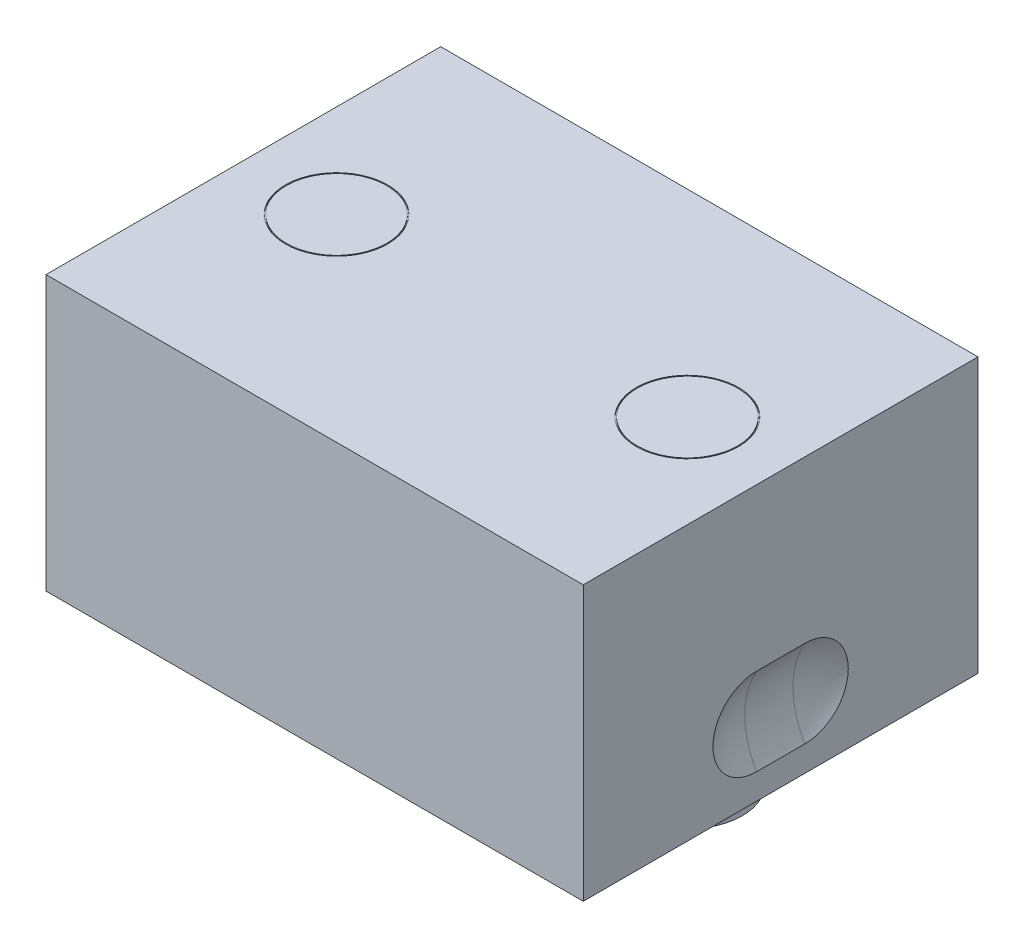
ISO-10303-21;
HEADER;
FILE_DESCRIPTION(('STEP AP214'),'2;1');
FILE_NAME('part.step','',(''),(''),'','','');
FILE_SCHEMA(('AUTOMOTIVE_DESIGN { 1 0 10303 214 1 1 1 1 }'));
ENDSEC;
DATA;
#1=APPLICATION_CONTEXT('core data for automotive mechanical design processes');
#2=APPLICATION_PROTOCOL_DEFINITION('international standard','automotive_design',2000,#1);
#3=PRODUCT_CONTEXT('',#1,'mechanical');
#4=PRODUCT('Part','Part','',(#3));
#5=PRODUCT_RELATED_PRODUCT_CATEGORY('part','',(#4));
#6=PRODUCT_DEFINITION_FORMATION('','',#4);
#7=PRODUCT_DEFINITION_CONTEXT('part definition',#1,'design');
#8=PRODUCT_DEFINITION('design','',#6,#7);
#9=PRODUCT_DEFINITION_SHAPE('','',#8);
#10=(LENGTH_UNIT() NAMED_UNIT(*) SI_UNIT(.MILLI.,.METRE.));
#11=(NAMED_UNIT(*) PLANE_ANGLE_UNIT() SI_UNIT($,.RADIAN.));
#12=(NAMED_UNIT(*) SI_UNIT($,.STERADIAN.) SOLID_ANGLE_UNIT());
#13=UNCERTAINTY_MEASURE_WITH_UNIT(LENGTH_MEASURE(1.E-05),#10,'distance_accuracy_value','');
#14=(GEOMETRIC_REPRESENTATION_CONTEXT(3) GLOBAL_UNCERTAINTY_ASSIGNED_CONTEXT((#13)) GLOBAL_UNIT_ASSIGNED_CONTEXT((#10,
#11,#12)) REPRESENTATION_CONTEXT('',''));
#15=CARTESIAN_POINT('',(0.,0.,0.));
#16=DIRECTION('',(0.,0.,1.));
#17=DIRECTION('',(1.,0.,0.));
#18=AXIS2_PLACEMENT_3D('',#15,#16,#17);
#19=CARTESIAN_POINT('',(-16.,72.,0.));
#20=DIRECTION('',(0.,1.,0.));
#21=DIRECTION('',(0.,0.,1.));
#22=AXIS2_PLACEMENT_3D('',#19,#20,#21);
#23=PLANE('',#22);
#24=CARTESIAN_POINT('',(-16.,72.,0.));
#25=DIRECTION('',(0.,-1.,0.));
#26=DIRECTION('',(0.,0.,-1.));
#27=AXIS2_PLACEMENT_3D('',#24,#25,#26);
#28=CIRCLE('',#27,4.57);
#29=CARTESIAN_POINT('',(-16.,72.,-4.57));
#30=VERTEX_POINT('',#29);
#31=EDGE_CURVE('E9',#30,#30,#28,.F.);
#32=ORIENTED_EDGE('',*,*,#31,.F.);
#33=EDGE_LOOP('',(#32));
#34=FACE_BOUND('',#33,.T.);
#35=ADVANCED_FACE('F14',(#34),#23,.F.);
#36=CARTESIAN_POINT('',(-16.,75.,0.));
#37=DIRECTION('',(0.,1.,0.));
#38=DIRECTION('',(0.,0.,1.));
#39=AXIS2_PLACEMENT_3D('',#36,#37,#38);
#40=PLANE('',#39);
#41=CARTESIAN_POINT('',(16.,75.,0.));
#42=DIRECTION('',(0.,1.,0.));
#43=DIRECTION('',(0.,0.,1.));
#44=AXIS2_PLACEMENT_3D('',#41,#42,#43);
#45=CIRCLE('',#44,4.67);
#46=CARTESIAN_POINT('',(16.,75.,4.67));
#47=VERTEX_POINT('',#46);
#48=EDGE_CURVE('E576',#47,#47,#45,.T.);
#49=ORIENTED_EDGE('',*,*,#48,.F.);
#50=EDGE_LOOP('',(#49));
#51=FACE_BOUND('',#50,.T.);
#52=CARTESIAN_POINT('',(-16.,75.,0.));
#53=DIRECTION('',(0.,1.,0.));
#54=DIRECTION('',(0.,0.,1.));
#55=AXIS2_PLACEMENT_3D('',#52,#53,#54);
#56=CIRCLE('',#55,4.67);
#57=CARTESIAN_POINT('',(-16.,75.,4.67));
#58=VERTEX_POINT('',#57);
#59=EDGE_CURVE('E590',#58,#58,#56,.T.);
#60=ORIENTED_EDGE('',*,*,#59,.F.);
#61=EDGE_LOOP('',(#60));
#62=FACE_BOUND('',#61,.T.);
#63=DIRECTION('',(1.,0.,0.));
#64=VECTOR('',#63,1.);
#65=CARTESIAN_POINT('',(0.,75.,-18.));
#66=LINE('',#65,#64);
#67=CARTESIAN_POINT('',(24.5,75.,-18.));
#68=VERTEX_POINT('',#67);
#69=CARTESIAN_POINT('',(-24.5,75.,-18.));
#70=VERTEX_POINT('',#69);
#71=EDGE_CURVE('E208',#68,#70,#66,.F.);
#72=ORIENTED_EDGE('',*,*,#71,.T.);
#73=DIRECTION('',(0.,0.,1.));
#74=VECTOR('',#73,1.);
#75=CARTESIAN_POINT('',(-24.5,75.,0.));
#76=LINE('',#75,#74);
#77=CARTESIAN_POINT('',(-24.5,75.,18.));
#78=VERTEX_POINT('',#77);
#79=EDGE_CURVE('E205',#70,#78,#76,.T.);
#80=ORIENTED_EDGE('',*,*,#79,.T.);
#81=DIRECTION('',(1.,0.,0.));
#82=VECTOR('',#81,1.);
#83=CARTESIAN_POINT('',(0.,75.,18.));
#84=LINE('',#83,#82);
#85=CARTESIAN_POINT('',(24.5,75.,18.));
#86=VERTEX_POINT('',#85);
#87=EDGE_CURVE('E244',#78,#86,#84,.T.);
#88=ORIENTED_EDGE('',*,*,#87,.T.);
#89=DIRECTION('',(0.,0.,1.));
#90=VECTOR('',#89,1.);
#91=CARTESIAN_POINT('',(24.5,75.,0.));
#92=LINE('',#91,#90);
#93=EDGE_CURVE('E247',#86,#68,#92,.F.);
#94=ORIENTED_EDGE('',*,*,#93,.T.);
#95=EDGE_LOOP('',(#72,#80,#88,#94));
#96=FACE_BOUND('',#95,.T.);
#97=ADVANCED_FACE('F186',(#51,#62,#96),#40,.T.);
#98=CARTESIAN_POINT('',(16.,72.,0.));
#99=DIRECTION('',(0.,1.,0.));
#100=DIRECTION('',(0.,0.,1.));
#101=AXIS2_PLACEMENT_3D('',#98,#99,#100);
#102=PLANE('',#101);
#103=CARTESIAN_POINT('',(16.,72.,0.));
#104=DIRECTION('',(0.,-1.,0.));
#105=DIRECTION('',(0.,0.,-1.));
#106=AXIS2_PLACEMENT_3D('',#103,#104,#105);
#107=CIRCLE('',#106,4.57);
#108=CARTESIAN_POINT('',(16.,72.,-4.57));
#109=VERTEX_POINT('',#108);
#110=EDGE_CURVE('E23',#109,#109,#107,.F.);
#111=ORIENTED_EDGE('',*,*,#110,.F.);
#112=EDGE_LOOP('',(#111));
#113=FACE_BOUND('',#112,.T.);
#114=ADVANCED_FACE('F133',(#113),#102,.F.);
#115=CARTESIAN_POINT('',(16.,62.5,0.));
#116=DIRECTION('',(0.,-1.,0.));
#117=DIRECTION('',(0.,0.,-1.));
#118=AXIS2_PLACEMENT_3D('',#115,#116,#117);
#119=CYLINDRICAL_SURFACE('',#118,4.57);
#120=CARTESIAN_POINT('',(16.,53.,0.));
#121=DIRECTION('',(0.,-1.,0.));
#122=DIRECTION('',(0.,0.,-1.));
#123=AXIS2_PLACEMENT_3D('',#120,#121,#122);
#124=CIRCLE('',#123,4.57);
#125=CARTESIAN_POINT('',(16.,53.,-4.57));
#126=VERTEX_POINT('',#125);
#127=EDGE_CURVE('E217',#126,#126,#124,.F.);
#128=ORIENTED_EDGE('',*,*,#127,.F.);
#129=EDGE_LOOP('',(#128));
#130=FACE_BOUND('',#129,.T.);
#131=ORIENTED_EDGE('',*,*,#110,.T.);
#132=EDGE_LOOP('',(#131));
#133=FACE_BOUND('',#132,.T.);
#134=ADVANCED_FACE('F185',(#130,#133),#119,.F.);
#135=CARTESIAN_POINT('',(19.785,53.,0.));
#136=DIRECTION('',(0.,-1.,0.));
#137=DIRECTION('',(0.,0.,-1.));
#138=AXIS2_PLACEMENT_3D('',#135,#136,#137);
#139=PLANE('',#138);
#140=ORIENTED_EDGE('',*,*,#127,.T.);
#141=EDGE_LOOP('',(#140));
#142=FACE_BOUND('',#141,.T.);
#143=CARTESIAN_POINT('',(16.,52.9999999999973,0.));
#144=DIRECTION('',(0.,1.,0.));
#145=DIRECTION('',(0.,0.,1.));
#146=AXIS2_PLACEMENT_3D('',#143,#144,#145);
#147=CIRCLE('',#146,3.00000000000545);
#148=CARTESIAN_POINT('',(16.,52.9999999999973,3.00000000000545));
#149=VERTEX_POINT('',#148);
#150=EDGE_CURVE('E228',#149,#149,#147,.T.);
#151=ORIENTED_EDGE('',*,*,#150,.F.);
#152=EDGE_LOOP('',(#151));
#153=FACE_BOUND('',#152,.T.);
#154=ADVANCED_FACE('F193',(#142,#153),#139,.F.);
#155=CARTESIAN_POINT('',(16.,52.9999999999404,0.));
#156=DIRECTION('',(0.,1.,0.));
#157=DIRECTION('',(0.,0.,1.));
#158=AXIS2_PLACEMENT_3D('',#155,#156,#157);
#159=CONICAL_SURFACE('',#158,2.99999999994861,0.785398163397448);
#160=CARTESIAN_POINT('',(16.,52.6,0.));
#161=DIRECTION('',(0.,-1.,0.));
#162=DIRECTION('',(0.,0.,-1.));
#163=AXIS2_PLACEMENT_3D('',#160,#161,#162);
#164=CIRCLE('',#163,2.6);
#165=CARTESIAN_POINT('',(16.,52.6,-2.6));
#166=VERTEX_POINT('',#165);
#167=EDGE_CURVE('E233',#166,#166,#164,.T.);
#168=ORIENTED_EDGE('',*,*,#167,.T.);
#169=EDGE_LOOP('',(#168));
#170=FACE_BOUND('',#169,.T.);
#171=ORIENTED_EDGE('',*,*,#150,.T.);
#172=EDGE_LOOP('',(#171));
#173=FACE_BOUND('',#172,.T.);
#174=ADVANCED_FACE('F316',(#170,#173),#159,.F.);
#175=CARTESIAN_POINT('',(16.,49.3,0.));
#176=DIRECTION('',(0.,-1.,0.));
#177=DIRECTION('',(0.,0.,-1.));
#178=AXIS2_PLACEMENT_3D('',#175,#176,#177);
#179=CYLINDRICAL_SURFACE('',#178,2.6);
#180=CARTESIAN_POINT('',(16.,46.,0.));
#181=DIRECTION('',(0.,-1.,0.));
#182=DIRECTION('',(0.,0.,-1.));
#183=AXIS2_PLACEMENT_3D('',#180,#181,#182);
#184=CIRCLE('',#183,2.6);
#185=CARTESIAN_POINT('',(16.,46.,-2.6));
#186=VERTEX_POINT('',#185);
#187=EDGE_CURVE('E223',#186,#186,#184,.F.);
#188=ORIENTED_EDGE('',*,*,#187,.F.);
#189=EDGE_LOOP('',(#188));
#190=FACE_BOUND('',#189,.T.);
#191=ORIENTED_EDGE('',*,*,#167,.F.);
#192=EDGE_LOOP('',(#191));
#193=FACE_BOUND('',#192,.T.);
#194=ADVANCED_FACE('F317',(#190,#193),#179,.F.);
#195=CARTESIAN_POINT('',(18.5,46.,0.));
#196=DIRECTION('',(0.,-1.,0.));
#197=DIRECTION('',(0.,0.,-1.));
#198=AXIS2_PLACEMENT_3D('',#195,#196,#197);
#199=PLANE('',#198);
#200=CARTESIAN_POINT('',(16.,46.,0.));
#201=DIRECTION('',(0.,-1.,0.));
#202=DIRECTION('',(0.,0.,-1.));
#203=AXIS2_PLACEMENT_3D('',#200,#201,#202);
#204=CIRCLE('',#203,5.);
#205=CARTESIAN_POINT('',(16.,46.,-5.));
#206=VERTEX_POINT('',#205);
#207=EDGE_CURVE('E79',#206,#206,#204,.F.);
#208=ORIENTED_EDGE('',*,*,#207,.F.);
#209=EDGE_LOOP('',(#208));
#210=FACE_BOUND('',#209,.T.);
#211=ORIENTED_EDGE('',*,*,#187,.T.);
#212=EDGE_LOOP('',(#211));
#213=FACE_BOUND('',#212,.T.);
#214=ADVANCED_FACE('F302',(#210,#213),#199,.T.);
#215=CARTESIAN_POINT('',(-16.,48.5,0.));
#216=DIRECTION('',(0.,-1.,0.));
#217=DIRECTION('',(0.,0.,-1.));
#218=AXIS2_PLACEMENT_3D('',#215,#216,#217);
#219=CYLINDRICAL_SURFACE('',#218,5.);
#220=CARTESIAN_POINT('',(-16.,50.,0.));
#221=DIRECTION('',(0.,-1.,0.));
#222=DIRECTION('',(0.,0.,-1.));
#223=AXIS2_PLACEMENT_3D('',#220,#221,#222);
#224=CIRCLE('',#223,5.);
#225=CARTESIAN_POINT('',(-16.,50.,-5.));
#226=VERTEX_POINT('',#225);
#227=EDGE_CURVE('E283',#226,#226,#224,.T.);
#228=ORIENTED_EDGE('',*,*,#227,.T.);
#229=EDGE_LOOP('',(#228));
#230=FACE_BOUND('',#229,.T.);
#231=CARTESIAN_POINT('',(-16.,46.,0.));
#232=DIRECTION('',(0.,-1.,0.));
#233=DIRECTION('',(0.,0.,-1.));
#234=AXIS2_PLACEMENT_3D('',#231,#232,#233);
#235=CIRCLE('',#234,5.);
#236=CARTESIAN_POINT('',(-16.,46.,-5.));
#237=VERTEX_POINT('',#236);
#238=EDGE_CURVE('E214',#237,#237,#235,.F.);
#239=ORIENTED_EDGE('',*,*,#238,.T.);
#240=EDGE_LOOP('',(#239));
#241=FACE_BOUND('',#240,.T.);
#242=ADVANCED_FACE('F197',(#230,#241),#219,.T.);
#243=CARTESIAN_POINT('',(16.,48.5,0.));
#244=DIRECTION('',(0.,-1.,0.));
#245=DIRECTION('',(0.,0.,-1.));
#246=AXIS2_PLACEMENT_3D('',#243,#244,#245);
#247=CYLINDRICAL_SURFACE('',#246,5.);
#248=CARTESIAN_POINT('',(16.,50.,0.));
#249=DIRECTION('',(0.,-1.,0.));
#250=DIRECTION('',(0.,0.,-1.));
#251=AXIS2_PLACEMENT_3D('',#248,#249,#250);
#252=CIRCLE('',#251,5.);
#253=CARTESIAN_POINT('',(16.,50.,-5.));
#254=VERTEX_POINT('',#253);
#255=EDGE_CURVE('E109',#254,#254,#252,.T.);
#256=ORIENTED_EDGE('',*,*,#255,.T.);
#257=EDGE_LOOP('',(#256));
#258=FACE_BOUND('',#257,.T.);
#259=ORIENTED_EDGE('',*,*,#207,.T.);
#260=EDGE_LOOP('',(#259));
#261=FACE_BOUND('',#260,.T.);
#262=ADVANCED_FACE('F301',(#258,#261),#247,.T.);
#263=CARTESIAN_POINT('',(31.3299999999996,56.3,2.20000000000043));
#264=DIRECTION('',(0.464793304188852,0.635942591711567,0.616071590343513));
#265=DIRECTION('',(0.885263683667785,-0.34681503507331,-0.309883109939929));
#266=AXIS2_PLACEMENT_3D('',#263,#264,#265);
#267=SPHERICAL_SURFACE('',#266,7.9);
#268=CARTESIAN_POINT('',(31.33,56.3,2.2));
#269=DIRECTION('',(0.,0.,-1.));
#270=DIRECTION('',(-1.,0.,0.));
#271=AXIS2_PLACEMENT_3D('',#268,#269,#270);
#272=CIRCLE('',#271,7.9);
#273=CARTESIAN_POINT('',(24.5,52.3299748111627,2.2));
#274=VERTEX_POINT('',#273);
#275=CARTESIAN_POINT('',(24.5,60.270025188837,2.2));
#276=VERTEX_POINT('',#275);
#277=EDGE_CURVE('E71',#274,#276,#272,.T.);
#278=ORIENTED_EDGE('',*,*,#277,.T.);
#279=CARTESIAN_POINT('',(24.5,52.3299748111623,2.2));
#280=CARTESIAN_POINT('',(24.5,52.3299641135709,2.31166044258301));
#281=CARTESIAN_POINT('',(24.5,52.3346855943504,2.42331581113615));
#282=CARTESIAN_POINT('',(24.5,52.3535101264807,2.64582772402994));
#283=CARTESIAN_POINT('',(24.5,52.3676127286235,2.75668430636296));
#284=CARTESIAN_POINT('',(24.5,52.4051035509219,2.97674344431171));
#285=CARTESIAN_POINT('',(24.5,52.4284852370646,3.08594710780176));
#286=CARTESIAN_POINT('',(24.5,52.4843445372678,3.30196987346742));
#287=CARTESIAN_POINT('',(24.5,52.516822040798,3.4087890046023));
#288=CARTESIAN_POINT('',(24.5,52.627634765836,3.72463545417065));
#289=CARTESIAN_POINT('',(24.5,52.7193661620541,3.92914501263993));
#290=CARTESIAN_POINT('',(24.5,52.9357981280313,4.31970636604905));
#291=CARTESIAN_POINT('',(24.5,53.0604922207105,4.50576177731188));
#292=CARTESIAN_POINT('',(24.5,53.339358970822,4.85433446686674));
#293=CARTESIAN_POINT('',(24.5,53.4935322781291,5.01685122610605));
#294=CARTESIAN_POINT('',(24.5,53.8269954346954,5.31371134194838));
#295=CARTESIAN_POINT('',(24.5,54.0062891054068,5.44805040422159));
#296=CARTESIAN_POINT('',(24.5,54.3848790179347,5.68471531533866));
#297=CARTESIAN_POINT('',(24.5,54.5841743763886,5.78704257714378));
#298=CARTESIAN_POINT('',(24.5,54.9971025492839,5.95677870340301));
#299=CARTESIAN_POINT('',(24.5,55.2107344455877,6.02418980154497));
#300=CARTESIAN_POINT('',(24.5,55.6462877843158,6.12219183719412));
#301=CARTESIAN_POINT('',(24.5,55.8682093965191,6.15278202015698));
#302=CARTESIAN_POINT('',(24.5,56.3140435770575,6.17627135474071));
#303=CARTESIAN_POINT('',(24.5,56.5379561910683,6.16916963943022));
#304=CARTESIAN_POINT('',(24.5,56.9814086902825,6.11747528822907));
#305=CARTESIAN_POINT('',(24.5,57.2009486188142,6.07288302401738));
#306=CARTESIAN_POINT('',(24.5,57.6294255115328,5.9474733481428));
#307=CARTESIAN_POINT('',(24.5,57.8383625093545,5.86665605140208));
#308=CARTESIAN_POINT('',(24.5,58.23970747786,5.67109073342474));
#309=CARTESIAN_POINT('',(24.4999999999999,58.432115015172,5.55634182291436));
#310=CARTESIAN_POINT('',(24.5000000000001,58.7949275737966,5.29616752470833));
#311=CARTESIAN_POINT('',(24.5000000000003,58.9653336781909,5.15074364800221));
#312=CARTESIAN_POINT('',(24.5000000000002,59.2792822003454,4.83340459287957));
#313=CARTESIAN_POINT('',(24.5,59.4228282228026,4.66149297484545));
#314=CARTESIAN_POINT('',(24.5,59.6791046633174,4.29583833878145));
#315=CARTESIAN_POINT('',(24.5000000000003,59.791825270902,4.10208839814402));
#316=CARTESIAN_POINT('',(24.5000000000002,59.93528242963,3.79948806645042));
#317=CARTESIAN_POINT('',(24.5,59.9788567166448,3.69653366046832));
#318=CARTESIAN_POINT('',(24.5,60.0571708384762,3.48732952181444));
#319=CARTESIAN_POINT('',(24.5,60.0919139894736,3.38108104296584));
#320=CARTESIAN_POINT('',(24.5,60.1522829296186,3.16616218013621));
#321=CARTESIAN_POINT('',(24.4999999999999,60.1779187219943,3.05749459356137));
#322=CARTESIAN_POINT('',(24.5000000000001,60.2199409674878,2.83842795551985));
#323=CARTESIAN_POINT('',(24.5000000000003,60.2363319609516,2.72802978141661));
#324=CARTESIAN_POINT('',(24.5000000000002,60.2553736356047,2.54782627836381));
#325=CARTESIAN_POINT('',(24.5000000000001,60.2608714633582,2.4783092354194));
#326=CARTESIAN_POINT('',(24.4999999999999,60.2681945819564,2.33919724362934));
#327=CARTESIAN_POINT('',(24.4999999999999,60.2700259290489,2.26960261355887));
#328=CARTESIAN_POINT('',(24.5,60.2700251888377,2.2));
#329=B_SPLINE_CURVE_WITH_KNOTS('',3,(#279,#280,#281,#282,#283,#284,#285,#286,#287,#288,#289,
#290,#291,#292,#293,#294,#295,#296,#297,#298,#299,#300,#301,#302,#303,#304,#305,#306,#307,#308,
#309,#310,#311,#312,#313,#314,#315,#316,#317,#318,#319,#320,#321,#322,#323,#324,#325,#326,#327,
#328),.UNSPECIFIED.,.F.,.F.,(4,2,2,2,2,2,2,2,2,2,2,2,2,2,2,2,2,2,2,2,2,2,2,2,4),(0.,
0.334872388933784,0.669728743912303,1.00434972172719,1.33896663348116,2.00792040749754,
2.67674283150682,3.34558000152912,4.01451902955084,4.68342852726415,5.35229522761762,
6.02117563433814,6.69007142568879,7.35896058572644,8.02784762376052,8.69675219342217,
9.36562382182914,10.0344056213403,10.7034000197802,11.0384618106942,11.3733975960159,
11.7079643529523,12.0423666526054,12.2514802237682,12.4602480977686),.UNSPECIFIED.);
#330=EDGE_CURVE('E76',#274,#276,#329,.T.);
#331=ORIENTED_EDGE('',*,*,#330,.F.);
#332=EDGE_LOOP('',(#278,#331));
#333=FACE_BOUND('',#332,.T.);
#334=ADVANCED_FACE('F74',(#333),#267,.F.);
#335=CARTESIAN_POINT('',(31.3299999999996,56.3,-2.20000000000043));
#336=DIRECTION('',(0.464793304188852,0.635942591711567,0.616071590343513));
#337=DIRECTION('',(0.885263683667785,-0.34681503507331,-0.309883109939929));
#338=AXIS2_PLACEMENT_3D('',#335,#336,#337);
#339=SPHERICAL_SURFACE('',#338,7.9);
#340=CARTESIAN_POINT('',(31.33,56.3,-2.2));
#341=DIRECTION('',(0.,0.,-1.));
#342=DIRECTION('',(-1.,0.,0.));
#343=AXIS2_PLACEMENT_3D('',#340,#341,#342);
#344=CIRCLE('',#343,7.9);
#345=CARTESIAN_POINT('',(24.5,52.329974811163,-2.2));
#346=VERTEX_POINT('',#345);
#347=CARTESIAN_POINT('',(24.5,60.2700251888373,-2.2));
#348=VERTEX_POINT('',#347);
#349=EDGE_CURVE('E78',#346,#348,#344,.T.);
#350=ORIENTED_EDGE('',*,*,#349,.F.);
#351=CARTESIAN_POINT('',(24.5,60.2700251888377,-2.2));
#352=CARTESIAN_POINT('',(24.5,60.2700358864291,-2.31166044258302));
#353=CARTESIAN_POINT('',(24.5,60.2653144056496,-2.42331581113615));
#354=CARTESIAN_POINT('',(24.5,60.2464898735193,-2.64582772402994));
#355=CARTESIAN_POINT('',(24.5,60.2323872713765,-2.75668430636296));
#356=CARTESIAN_POINT('',(24.5,60.1948964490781,-2.97674344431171));
#357=CARTESIAN_POINT('',(24.5,60.1715147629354,-3.08594710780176));
#358=CARTESIAN_POINT('',(24.5,60.1156554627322,-3.30196987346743));
#359=CARTESIAN_POINT('',(24.5,60.0831779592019,-3.4087890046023));
#360=CARTESIAN_POINT('',(24.5,59.972365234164,-3.72463545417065));
#361=CARTESIAN_POINT('',(24.5,59.8806338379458,-3.92914501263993));
#362=CARTESIAN_POINT('',(24.5,59.6642018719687,-4.31970636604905));
#363=CARTESIAN_POINT('',(24.5,59.5395077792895,-4.50576177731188));
#364=CARTESIAN_POINT('',(24.5,59.260641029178,-4.85433446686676));
#365=CARTESIAN_POINT('',(24.5,59.1064677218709,-5.01685122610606));
#366=CARTESIAN_POINT('',(24.5,58.7730045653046,-5.3137113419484));
#367=CARTESIAN_POINT('',(24.5,58.5937108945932,-5.4480504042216));
#368=CARTESIAN_POINT('',(24.5,58.2151209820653,-5.68471531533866));
#369=CARTESIAN_POINT('',(24.5,58.0158256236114,-5.78704257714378));
#370=CARTESIAN_POINT('',(24.5,57.6028974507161,-5.956778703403));
#371=CARTESIAN_POINT('',(24.5,57.3892655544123,-6.02418980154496));
#372=CARTESIAN_POINT('',(24.5,56.9537122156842,-6.12219183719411));
#373=CARTESIAN_POINT('',(24.5,56.7317906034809,-6.15278202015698));
#374=CARTESIAN_POINT('',(24.5,56.2859564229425,-6.17627135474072));
#375=CARTESIAN_POINT('',(24.5,56.0620438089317,-6.16916963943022));
#376=CARTESIAN_POINT('',(24.5,55.6185913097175,-6.11747528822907));
#377=CARTESIAN_POINT('',(24.5,55.3990513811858,-6.07288302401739));
#378=CARTESIAN_POINT('',(24.5,54.9705744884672,-5.94747334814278));
#379=CARTESIAN_POINT('',(24.5,54.7616374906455,-5.86665605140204));
#380=CARTESIAN_POINT('',(24.5,54.3602925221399,-5.67109073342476));
#381=CARTESIAN_POINT('',(24.5,54.1678849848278,-5.55634182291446));
#382=CARTESIAN_POINT('',(24.5,53.8050724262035,-5.2961675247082));
#383=CARTESIAN_POINT('',(24.5,53.6346663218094,-5.15074364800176));
#384=CARTESIAN_POINT('',(24.5,53.3207177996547,-4.83340459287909));
#385=CARTESIAN_POINT('',(24.5,53.1771717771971,-4.66149297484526));
#386=CARTESIAN_POINT('',(24.5,52.9208953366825,-4.29583833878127));
#387=CARTESIAN_POINT('',(24.5,52.8081747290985,-4.10208839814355));
#388=CARTESIAN_POINT('',(24.5,52.6647175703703,-3.79948806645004));
#389=CARTESIAN_POINT('',(24.5,52.6211432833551,-3.69653366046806));
#390=CARTESIAN_POINT('',(24.5,52.5428291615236,-3.48732952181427));
#391=CARTESIAN_POINT('',(24.5,52.5080860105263,-3.38108104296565));
#392=CARTESIAN_POINT('',(24.5,52.4477170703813,-3.16616218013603));
#393=CARTESIAN_POINT('',(24.5,52.4220812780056,-3.05749459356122));
#394=CARTESIAN_POINT('',(24.5,52.3800590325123,-2.83842795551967));
#395=CARTESIAN_POINT('',(24.5,52.3636680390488,-2.72802978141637));
#396=CARTESIAN_POINT('',(24.5,52.3446263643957,-2.54782627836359));
#397=CARTESIAN_POINT('',(24.5,52.3391285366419,-2.47830923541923));
#398=CARTESIAN_POINT('',(24.5,52.3318054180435,-2.33919724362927));
#399=CARTESIAN_POINT('',(24.5,52.3299740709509,-2.26960261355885));
#400=CARTESIAN_POINT('',(24.5,52.3299748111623,-2.2));
#401=B_SPLINE_CURVE_WITH_KNOTS('',3,(#351,#352,#353,#354,#355,#356,#357,#358,#359,#360,#361,
#362,#363,#364,#365,#366,#367,#368,#369,#370,#371,#372,#373,#374,#375,#376,#377,#378,#379,#380,
#381,#382,#383,#384,#385,#386,#387,#388,#389,#390,#391,#392,#393,#394,#395,#396,#397,#398,#399,
#400),.UNSPECIFIED.,.F.,.F.,(4,2,2,2,2,2,2,2,2,2,2,2,2,2,2,2,2,2,2,2,2,2,2,2,4),(0.,
0.334872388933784,0.669728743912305,1.00434972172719,1.33896663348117,2.00792040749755,
2.67674283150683,3.34558000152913,4.01451902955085,4.68342852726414,5.35229522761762,
6.02117563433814,6.69007142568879,7.35896058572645,8.02784762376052,8.69675219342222,
9.3656238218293,10.0344056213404,10.7034000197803,11.0384618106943,11.373397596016,
11.7079643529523,12.0423666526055,12.2514802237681,12.4602480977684),.UNSPECIFIED.);
#402=EDGE_CURVE('E88',#348,#346,#401,.T.);
#403=ORIENTED_EDGE('',*,*,#402,.F.);
#404=EDGE_LOOP('',(#350,#403));
#405=FACE_BOUND('',#404,.T.);
#406=ADVANCED_FACE('F159',(#405),#339,.F.);
#407=CARTESIAN_POINT('',(31.33,56.3,0.));
#408=DIRECTION('',(0.,0.,-1.));
#409=DIRECTION('',(-1.,0.,0.));
#410=AXIS2_PLACEMENT_3D('',#407,#408,#409);
#411=CYLINDRICAL_SURFACE('',#410,7.9);
#412=ORIENTED_EDGE('',*,*,#277,.F.);
#413=DIRECTION('',(0.,0.,-1.));
#414=VECTOR('',#413,1.);
#415=CARTESIAN_POINT('',(24.5,52.329974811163,-18.));
#416=LINE('',#415,#414);
#417=EDGE_CURVE('E91',#346,#274,#416,.F.);
#418=ORIENTED_EDGE('',*,*,#417,.F.);
#419=ORIENTED_EDGE('',*,*,#349,.T.);
#420=DIRECTION('',(0.,0.,-1.));
#421=VECTOR('',#420,1.);
#422=CARTESIAN_POINT('',(24.5,60.270025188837,-18.));
#423=LINE('',#422,#421);
#424=EDGE_CURVE('E82',#276,#348,#423,.T.);
#425=ORIENTED_EDGE('',*,*,#424,.F.);
#426=EDGE_LOOP('',(#412,#418,#419,#425));
#427=FACE_BOUND('',#426,.T.);
#428=ADVANCED_FACE('F83',(#427),#411,.F.);
#429=CARTESIAN_POINT('',(-31.3299999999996,56.3,-2.20000000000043));
#430=DIRECTION('',(0.464793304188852,0.635942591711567,0.616071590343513));
#431=DIRECTION('',(0.885263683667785,-0.34681503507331,-0.309883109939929));
#432=AXIS2_PLACEMENT_3D('',#429,#430,#431);
#433=SPHERICAL_SURFACE('',#432,7.9);
#434=CARTESIAN_POINT('',(-31.33,56.3,-2.2));
#435=DIRECTION('',(0.,0.,1.));
#436=DIRECTION('',(1.,0.,0.));
#437=AXIS2_PLACEMENT_3D('',#434,#435,#436);
#438=CIRCLE('',#437,7.9);
#439=CARTESIAN_POINT('',(-24.5,52.3299748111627,-2.2));
#440=VERTEX_POINT('',#439);
#441=CARTESIAN_POINT('',(-24.5,60.270025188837,-2.2));
#442=VERTEX_POINT('',#441);
#443=EDGE_CURVE('E290',#440,#442,#438,.T.);
#444=ORIENTED_EDGE('',*,*,#443,.T.);
#445=CARTESIAN_POINT('',(-24.5,52.3299748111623,-2.2));
#446=CARTESIAN_POINT('',(-24.5,52.3299641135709,-2.311660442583));
#447=CARTESIAN_POINT('',(-24.5,52.3346855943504,-2.42331581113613));
#448=CARTESIAN_POINT('',(-24.5,52.3535101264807,-2.64582772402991));
#449=CARTESIAN_POINT('',(-24.5,52.3676127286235,-2.75668430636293));
#450=CARTESIAN_POINT('',(-24.5,52.4051035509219,-2.97674344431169));
#451=CARTESIAN_POINT('',(-24.5,52.4284852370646,-3.08594710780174));
#452=CARTESIAN_POINT('',(-24.5,52.4843445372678,-3.30196987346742));
#453=CARTESIAN_POINT('',(-24.5,52.516822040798,-3.40878900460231));
#454=CARTESIAN_POINT('',(-24.5,52.627634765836,-3.72463545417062));
#455=CARTESIAN_POINT('',(-24.4999999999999,52.7193661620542,-3.9291450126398));
#456=CARTESIAN_POINT('',(-24.5000000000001,52.9357981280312,-4.31970636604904));
#457=CARTESIAN_POINT('',(-24.5000000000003,53.06049222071,-4.50576177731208));
#458=CARTESIAN_POINT('',(-24.5000000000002,53.3393589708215,-4.85433446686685));
#459=CARTESIAN_POINT('',(-24.5,53.4935322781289,-5.01685122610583));
#460=CARTESIAN_POINT('',(-24.5,53.8269954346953,-5.31371134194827));
#461=CARTESIAN_POINT('',(-24.5000000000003,54.0062891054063,-5.44805040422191));
#462=CARTESIAN_POINT('',(-24.5000000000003,54.3848790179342,-5.68471531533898));
#463=CARTESIAN_POINT('',(-24.5,54.5841743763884,-5.78704257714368));
#464=CARTESIAN_POINT('',(-24.5,54.9971025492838,-5.95677870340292));
#465=CARTESIAN_POINT('',(-24.5000000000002,55.2107344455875,-6.02418980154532));
#466=CARTESIAN_POINT('',(-24.5000000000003,55.6462877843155,-6.12219183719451));
#467=CARTESIAN_POINT('',(-24.5000000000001,55.8682093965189,-6.15278202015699));
#468=CARTESIAN_POINT('',(-24.4999999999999,56.3140435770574,-6.17627135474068));
#469=CARTESIAN_POINT('',(-24.5,56.5379561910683,-6.16916963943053));
#470=CARTESIAN_POINT('',(-24.5,56.9814086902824,-6.11747528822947));
#471=CARTESIAN_POINT('',(-24.5,57.2009486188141,-6.07288302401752));
#472=CARTESIAN_POINT('',(-24.5,57.6294255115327,-5.94747334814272));
#473=CARTESIAN_POINT('',(-24.5,57.8383625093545,-5.86665605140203));
#474=CARTESIAN_POINT('',(-24.5,58.2397074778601,-5.67109073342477));
#475=CARTESIAN_POINT('',(-24.5,58.4321150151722,-5.55634182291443));
#476=CARTESIAN_POINT('',(-24.5,58.7949275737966,-5.29616752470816));
#477=CARTESIAN_POINT('',(-24.5,58.9653336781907,-5.15074364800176));
#478=CARTESIAN_POINT('',(-24.5,59.2792822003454,-4.83340459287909));
#479=CARTESIAN_POINT('',(-24.5,59.4228282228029,-4.66149297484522));
#480=CARTESIAN_POINT('',(-24.5,59.6791046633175,-4.29583833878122));
#481=CARTESIAN_POINT('',(-24.5,59.7918252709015,-4.10208839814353));
#482=CARTESIAN_POINT('',(-24.5,59.9352824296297,-3.79948806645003));
#483=CARTESIAN_POINT('',(-24.5,59.9788567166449,-3.69653366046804));
#484=CARTESIAN_POINT('',(-24.5,60.0571708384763,-3.48732952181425));
#485=CARTESIAN_POINT('',(-24.5,60.0919139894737,-3.38108104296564));
#486=CARTESIAN_POINT('',(-24.5,60.1522829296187,-3.16616218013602));
#487=CARTESIAN_POINT('',(-24.5,60.1779187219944,-3.05749459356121));
#488=CARTESIAN_POINT('',(-24.5,60.2199409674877,-2.83842795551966));
#489=CARTESIAN_POINT('',(-24.5,60.2363319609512,-2.72802978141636));
#490=CARTESIAN_POINT('',(-24.5,60.2553736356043,-2.54782627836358));
#491=CARTESIAN_POINT('',(-24.5,60.2608714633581,-2.47830923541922));
#492=CARTESIAN_POINT('',(-24.5,60.2681945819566,-2.33919724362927));
#493=CARTESIAN_POINT('',(-24.5,60.2700259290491,-2.26960261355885));
#494=CARTESIAN_POINT('',(-24.5,60.2700251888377,-2.2));
#495=B_SPLINE_CURVE_WITH_KNOTS('',3,(#445,#446,#447,#448,#449,#450,#451,#452,#453,#454,#455,
#456,#457,#458,#459,#460,#461,#462,#463,#464,#465,#466,#467,#468,#469,#470,#471,#472,#473,#474,
#475,#476,#477,#478,#479,#480,#481,#482,#483,#484,#485,#486,#487,#488,#489,#490,#491,#492,#493,
#494),.UNSPECIFIED.,.F.,.F.,(4,2,2,2,2,2,2,2,2,2,2,2,2,2,2,2,2,2,2,2,2,2,2,2,4),(0.,
0.334872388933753,0.669728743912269,1.00434972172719,1.33896663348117,2.00792040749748,
2.67674283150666,3.34558000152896,4.0145190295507,4.68342852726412,5.35229522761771,
6.02117563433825,6.69007142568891,7.35896058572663,8.02784762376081,8.69675219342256,
9.36562382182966,10.0344056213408,10.7034000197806,11.0384618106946,11.3733975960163,
11.7079643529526,12.0423666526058,12.2514802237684,12.4602480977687),.UNSPECIFIED.);
#496=EDGE_CURVE('E143',#440,#442,#495,.T.);
#497=ORIENTED_EDGE('',*,*,#496,.F.);
#498=EDGE_LOOP('',(#444,#497));
#499=FACE_BOUND('',#498,.T.);
#500=ADVANCED_FACE('F152',(#499),#433,.F.);
#501=CARTESIAN_POINT('',(-31.3299999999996,56.3,2.20000000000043));
#502=DIRECTION('',(0.464793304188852,0.635942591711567,0.616071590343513));
#503=DIRECTION('',(0.885263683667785,-0.34681503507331,-0.309883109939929));
#504=AXIS2_PLACEMENT_3D('',#501,#502,#503);
#505=SPHERICAL_SURFACE('',#504,7.9);
#506=CARTESIAN_POINT('',(-31.33,56.3,2.2));
#507=DIRECTION('',(0.,0.,1.));
#508=DIRECTION('',(1.,0.,0.));
#509=AXIS2_PLACEMENT_3D('',#506,#507,#508);
#510=CIRCLE('',#509,7.9);
#511=CARTESIAN_POINT('',(-24.5,52.329974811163,2.2));
#512=VERTEX_POINT('',#511);
#513=CARTESIAN_POINT('',(-24.5,60.2700251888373,2.2));
#514=VERTEX_POINT('',#513);
#515=EDGE_CURVE('E287',#512,#514,#510,.T.);
#516=ORIENTED_EDGE('',*,*,#515,.F.);
#517=CARTESIAN_POINT('',(-24.5,60.2700251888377,2.2));
#518=CARTESIAN_POINT('',(-24.5,60.2700358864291,2.31166044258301));
#519=CARTESIAN_POINT('',(-24.5,60.2653144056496,2.42331581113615));
#520=CARTESIAN_POINT('',(-24.5,60.2464898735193,2.64582772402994));
#521=CARTESIAN_POINT('',(-24.5,60.2323872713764,2.75668430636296));
#522=CARTESIAN_POINT('',(-24.5,60.1948964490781,2.97674344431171));
#523=CARTESIAN_POINT('',(-24.5,60.1715147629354,3.08594710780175));
#524=CARTESIAN_POINT('',(-24.5,60.1156554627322,3.30196987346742));
#525=CARTESIAN_POINT('',(-24.5,60.0831779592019,3.4087890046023));
#526=CARTESIAN_POINT('',(-24.5,59.972365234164,3.72463545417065));
#527=CARTESIAN_POINT('',(-24.5,59.8806338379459,3.92914501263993));
#528=CARTESIAN_POINT('',(-24.5,59.6642018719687,4.31970636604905));
#529=CARTESIAN_POINT('',(-24.5,59.5395077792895,4.50576177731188));
#530=CARTESIAN_POINT('',(-24.5,59.260641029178,4.85433446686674));
#531=CARTESIAN_POINT('',(-24.5,59.1064677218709,5.01685122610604));
#532=CARTESIAN_POINT('',(-24.5,58.7730045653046,5.31371134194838));
#533=CARTESIAN_POINT('',(-24.5,58.5937108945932,5.44805040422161));
#534=CARTESIAN_POINT('',(-24.5,58.2151209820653,5.68471531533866));
#535=CARTESIAN_POINT('',(-24.5,58.0158256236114,5.78704257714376));
#536=CARTESIAN_POINT('',(-24.5,57.6028974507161,5.95677870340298));
#537=CARTESIAN_POINT('',(-24.5,57.3892655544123,6.02418980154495));
#538=CARTESIAN_POINT('',(-24.5,56.9537122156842,6.1221918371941));
#539=CARTESIAN_POINT('',(-24.5,56.7317906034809,6.15278202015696));
#540=CARTESIAN_POINT('',(-24.5,56.2859564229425,6.1762713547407));
#541=CARTESIAN_POINT('',(-24.5,56.0620438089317,6.16916963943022));
#542=CARTESIAN_POINT('',(-24.5,55.6185913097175,6.11747528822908));
#543=CARTESIAN_POINT('',(-24.5,55.3990513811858,6.07288302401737));
#544=CARTESIAN_POINT('',(-24.5,54.9705744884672,5.94747334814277));
#545=CARTESIAN_POINT('',(-24.5,54.7616374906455,5.86665605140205));
#546=CARTESIAN_POINT('',(-24.5,54.3602925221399,5.67109073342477));
#547=CARTESIAN_POINT('',(-24.5,54.1678849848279,5.55634182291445));
#548=CARTESIAN_POINT('',(-24.5,53.8050724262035,5.29616752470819));
#549=CARTESIAN_POINT('',(-24.5,53.6346663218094,5.15074364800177));
#550=CARTESIAN_POINT('',(-24.5,53.3207177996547,4.83340459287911));
#551=CARTESIAN_POINT('',(-24.5,53.1771717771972,4.66149297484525));
#552=CARTESIAN_POINT('',(-24.5,52.9208953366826,4.29583833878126));
#553=CARTESIAN_POINT('',(-24.5,52.8081747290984,4.10208839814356));
#554=CARTESIAN_POINT('',(-24.5,52.6647175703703,3.79948806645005));
#555=CARTESIAN_POINT('',(-24.5,52.6211432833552,3.69653366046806));
#556=CARTESIAN_POINT('',(-24.5,52.5428291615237,3.48732952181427));
#557=CARTESIAN_POINT('',(-24.5,52.5080860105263,3.38108104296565));
#558=CARTESIAN_POINT('',(-24.5,52.4477170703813,3.16616218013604));
#559=CARTESIAN_POINT('',(-24.5,52.4220812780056,3.05749459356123));
#560=CARTESIAN_POINT('',(-24.5,52.3800590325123,2.83842795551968));
#561=CARTESIAN_POINT('',(-24.5,52.3636680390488,2.72802978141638));
#562=CARTESIAN_POINT('',(-24.5,52.3446263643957,2.54782627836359));
#563=CARTESIAN_POINT('',(-24.5,52.3391285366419,2.47830923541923));
#564=CARTESIAN_POINT('',(-24.5,52.3318054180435,2.33919724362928));
#565=CARTESIAN_POINT('',(-24.5,52.3299740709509,2.26960261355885));
#566=CARTESIAN_POINT('',(-24.5,52.3299748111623,2.2));
#567=B_SPLINE_CURVE_WITH_KNOTS('',3,(#517,#518,#519,#520,#521,#522,#523,#524,#525,#526,#527,
#528,#529,#530,#531,#532,#533,#534,#535,#536,#537,#538,#539,#540,#541,#542,#543,#544,#545,#546,
#547,#548,#549,#550,#551,#552,#553,#554,#555,#556,#557,#558,#559,#560,#561,#562,#563,#564,#565,
#566),.UNSPECIFIED.,.F.,.F.,(4,2,2,2,2,2,2,2,2,2,2,2,2,2,2,2,2,2,2,2,2,2,2,2,4),(0.,
0.334872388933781,0.669728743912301,1.00434972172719,1.33896663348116,2.00792040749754,
2.67674283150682,3.34558000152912,4.01451902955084,4.68342852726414,5.35229522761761,
6.02117563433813,6.69007142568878,7.35896058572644,8.0278476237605,8.6967521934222,
9.36562382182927,10.0344056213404,10.7034000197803,11.0384618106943,11.373397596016,
11.7079643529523,12.0423666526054,12.2514802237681,12.4602480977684),.UNSPECIFIED.);
#568=EDGE_CURVE('E136',#514,#512,#567,.T.);
#569=ORIENTED_EDGE('',*,*,#568,.F.);
#570=EDGE_LOOP('',(#516,#569));
#571=FACE_BOUND('',#570,.T.);
#572=ADVANCED_FACE('F157',(#571),#505,.F.);
#573=CARTESIAN_POINT('',(-31.33,56.3,0.));
#574=DIRECTION('',(0.,0.,1.));
#575=DIRECTION('',(1.,0.,0.));
#576=AXIS2_PLACEMENT_3D('',#573,#574,#575);
#577=CYLINDRICAL_SURFACE('',#576,7.9);
#578=ORIENTED_EDGE('',*,*,#443,.F.);
#579=DIRECTION('',(0.,0.,1.));
#580=VECTOR('',#579,1.);
#581=CARTESIAN_POINT('',(-24.5,52.329974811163,18.));
#582=LINE('',#581,#580);
#583=EDGE_CURVE('E151',#512,#440,#582,.F.);
#584=ORIENTED_EDGE('',*,*,#583,.F.);
#585=ORIENTED_EDGE('',*,*,#515,.T.);
#586=DIRECTION('',(0.,0.,1.));
#587=VECTOR('',#586,1.);
#588=CARTESIAN_POINT('',(-24.5,60.270025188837,18.));
#589=LINE('',#588,#587);
#590=EDGE_CURVE('E150',#442,#514,#589,.T.);
#591=ORIENTED_EDGE('',*,*,#590,.F.);
#592=EDGE_LOOP('',(#578,#584,#585,#591));
#593=FACE_BOUND('',#592,.T.);
#594=ADVANCED_FACE('F160',(#593),#577,.F.);
#595=CARTESIAN_POINT('',(0.,50.,0.));
#596=DIRECTION('',(0.,1.,0.));
#597=DIRECTION('',(0.,0.,1.));
#598=AXIS2_PLACEMENT_3D('',#595,#596,#597);
#599=PLANE('',#598);
#600=DIRECTION('',(1.,0.,0.));
#601=VECTOR('',#600,1.);
#602=CARTESIAN_POINT('',(24.5,50.,18.));
#603=LINE('',#602,#601);
#604=CARTESIAN_POINT('',(-24.5,50.,18.));
#605=VERTEX_POINT('',#604);
#606=CARTESIAN_POINT('',(24.5,50.,18.));
#607=VERTEX_POINT('',#606);
#608=EDGE_CURVE('E93',#605,#607,#603,.T.);
#609=ORIENTED_EDGE('',*,*,#608,.F.);
#610=DIRECTION('',(0.,0.,1.));
#611=VECTOR('',#610,1.);
#612=CARTESIAN_POINT('',(-24.5,50.,18.));
#613=LINE('',#612,#611);
#614=CARTESIAN_POINT('',(-24.5,50.,-18.));
#615=VERTEX_POINT('',#614);
#616=EDGE_CURVE('E259',#615,#605,#613,.T.);
#617=ORIENTED_EDGE('',*,*,#616,.F.);
#618=DIRECTION('',(-1.,0.,0.));
#619=VECTOR('',#618,1.);
#620=CARTESIAN_POINT('',(-24.5,50.,-18.));
#621=LINE('',#620,#619);
#622=CARTESIAN_POINT('',(24.5,50.,-18.));
#623=VERTEX_POINT('',#622);
#624=EDGE_CURVE('E255',#623,#615,#621,.T.);
#625=ORIENTED_EDGE('',*,*,#624,.F.);
#626=DIRECTION('',(0.,0.,-1.));
#627=VECTOR('',#626,1.);
#628=CARTESIAN_POINT('',(24.5,50.,-18.));
#629=LINE('',#628,#627);
#630=EDGE_CURVE('E267',#607,#623,#629,.T.);
#631=ORIENTED_EDGE('',*,*,#630,.F.);
#632=EDGE_LOOP('',(#609,#617,#625,#631));
#633=FACE_BOUND('',#632,.T.);
#634=ORIENTED_EDGE('',*,*,#255,.F.);
#635=EDGE_LOOP('',(#634));
#636=FACE_BOUND('',#635,.T.);
#637=ORIENTED_EDGE('',*,*,#227,.F.);
#638=EDGE_LOOP('',(#637));
#639=FACE_BOUND('',#638,.T.);
#640=ADVANCED_FACE('F120',(#633,#636,#639),#599,.F.);
#641=CARTESIAN_POINT('',(24.5,50.,-18.));
#642=DIRECTION('',(1.,0.,0.));
#643=DIRECTION('',(0.,0.,-1.));
#644=AXIS2_PLACEMENT_3D('',#641,#642,#643);
#645=PLANE('',#644);
#646=ORIENTED_EDGE('',*,*,#630,.T.);
#647=DIRECTION('',(0.,1.,0.));
#648=VECTOR('',#647,1.);
#649=CARTESIAN_POINT('',(24.5,50.,-18.));
#650=LINE('',#649,#648);
#651=EDGE_CURVE('E264',#68,#623,#650,.F.);
#652=ORIENTED_EDGE('',*,*,#651,.F.);
#653=ORIENTED_EDGE('',*,*,#93,.F.);
#654=DIRECTION('',(0.,1.,0.));
#655=VECTOR('',#654,1.);
#656=CARTESIAN_POINT('',(24.5,50.,18.));
#657=LINE('',#656,#655);
#658=EDGE_CURVE('E269',#86,#607,#657,.F.);
#659=ORIENTED_EDGE('',*,*,#658,.T.);
#660=EDGE_LOOP('',(#646,#652,#653,#659));
#661=FACE_BOUND('',#660,.T.);
#662=ORIENTED_EDGE('',*,*,#424,.T.);
#663=ORIENTED_EDGE('',*,*,#402,.T.);
#664=ORIENTED_EDGE('',*,*,#417,.T.);
#665=ORIENTED_EDGE('',*,*,#330,.T.);
#666=EDGE_LOOP('',(#662,#663,#664,#665));
#667=FACE_BOUND('',#666,.T.);
#668=ADVANCED_FACE('F90',(#661,#667),#645,.T.);
#669=CARTESIAN_POINT('',(24.5,50.,18.));
#670=DIRECTION('',(0.,0.,1.));
#671=DIRECTION('',(1.,0.,0.));
#672=AXIS2_PLACEMENT_3D('',#669,#670,#671);
#673=PLANE('',#672);
#674=ORIENTED_EDGE('',*,*,#608,.T.);
#675=ORIENTED_EDGE('',*,*,#658,.F.);
#676=ORIENTED_EDGE('',*,*,#87,.F.);
#677=DIRECTION('',(0.,1.,0.));
#678=VECTOR('',#677,1.);
#679=CARTESIAN_POINT('',(-24.5,50.,18.));
#680=LINE('',#679,#678);
#681=EDGE_CURVE('E248',#605,#78,#680,.T.);
#682=ORIENTED_EDGE('',*,*,#681,.F.);
#683=EDGE_LOOP('',(#674,#675,#676,#682));
#684=FACE_BOUND('',#683,.T.);
#685=ADVANCED_FACE('F119',(#684),#673,.T.);
#686=CARTESIAN_POINT('',(-24.5,50.,18.));
#687=DIRECTION('',(-1.,0.,0.));
#688=DIRECTION('',(0.,0.,1.));
#689=AXIS2_PLACEMENT_3D('',#686,#687,#688);
#690=PLANE('',#689);
#691=ORIENTED_EDGE('',*,*,#616,.T.);
#692=ORIENTED_EDGE('',*,*,#681,.T.);
#693=ORIENTED_EDGE('',*,*,#79,.F.);
#694=DIRECTION('',(0.,1.,0.));
#695=VECTOR('',#694,1.);
#696=CARTESIAN_POINT('',(-24.5,50.,-18.));
#697=LINE('',#696,#695);
#698=EDGE_CURVE('E32',#70,#615,#697,.F.);
#699=ORIENTED_EDGE('',*,*,#698,.T.);
#700=EDGE_LOOP('',(#691,#692,#693,#699));
#701=FACE_BOUND('',#700,.T.);
#702=ORIENTED_EDGE('',*,*,#590,.T.);
#703=ORIENTED_EDGE('',*,*,#568,.T.);
#704=ORIENTED_EDGE('',*,*,#583,.T.);
#705=ORIENTED_EDGE('',*,*,#496,.T.);
#706=EDGE_LOOP('',(#702,#703,#704,#705));
#707=FACE_BOUND('',#706,.T.);
#708=ADVANCED_FACE('F128',(#701,#707),#690,.T.);
#709=CARTESIAN_POINT('',(-24.5,50.,-18.));
#710=DIRECTION('',(0.,0.,-1.));
#711=DIRECTION('',(-1.,0.,0.));
#712=AXIS2_PLACEMENT_3D('',#709,#710,#711);
#713=PLANE('',#712);
#714=ORIENTED_EDGE('',*,*,#624,.T.);
#715=ORIENTED_EDGE('',*,*,#698,.F.);
#716=ORIENTED_EDGE('',*,*,#71,.F.);
#717=ORIENTED_EDGE('',*,*,#651,.T.);
#718=EDGE_LOOP('',(#714,#715,#716,#717));
#719=FACE_BOUND('',#718,.T.);
#720=ADVANCED_FACE('F122',(#719),#713,.T.);
#721=CARTESIAN_POINT('',(-13.5,46.,0.));
#722=DIRECTION('',(0.,-1.,0.));
#723=DIRECTION('',(0.,0.,-1.));
#724=AXIS2_PLACEMENT_3D('',#721,#722,#723);
#725=PLANE('',#724);
#726=ORIENTED_EDGE('',*,*,#238,.F.);
#727=EDGE_LOOP('',(#726));
#728=FACE_BOUND('',#727,.T.);
#729=CARTESIAN_POINT('',(-16.,46.,0.));
#730=DIRECTION('',(0.,-1.,0.));
#731=DIRECTION('',(0.,0.,-1.));
#732=AXIS2_PLACEMENT_3D('',#729,#730,#731);
#733=CIRCLE('',#732,2.6);
#734=CARTESIAN_POINT('',(-16.,46.,-2.6));
#735=VERTEX_POINT('',#734);
#736=EDGE_CURVE('E226',#735,#735,#733,.F.);
#737=ORIENTED_EDGE('',*,*,#736,.T.);
#738=EDGE_LOOP('',(#737));
#739=FACE_BOUND('',#738,.T.);
#740=ADVANCED_FACE('F127',(#728,#739),#725,.T.);
#741=CARTESIAN_POINT('',(-16.,49.3,0.));
#742=DIRECTION('',(0.,-1.,0.));
#743=DIRECTION('',(0.,0.,-1.));
#744=AXIS2_PLACEMENT_3D('',#741,#742,#743);
#745=CYLINDRICAL_SURFACE('',#744,2.6);
#746=ORIENTED_EDGE('',*,*,#736,.F.);
#747=EDGE_LOOP('',(#746));
#748=FACE_BOUND('',#747,.T.);
#749=CARTESIAN_POINT('',(-16.,52.6,0.));
#750=DIRECTION('',(0.,-1.,0.));
#751=DIRECTION('',(0.,0.,-1.));
#752=AXIS2_PLACEMENT_3D('',#749,#750,#751);
#753=CIRCLE('',#752,2.6);
#754=CARTESIAN_POINT('',(-16.,52.6,-2.6));
#755=VERTEX_POINT('',#754);
#756=EDGE_CURVE('E237',#755,#755,#753,.T.);
#757=ORIENTED_EDGE('',*,*,#756,.F.);
#758=EDGE_LOOP('',(#757));
#759=FACE_BOUND('',#758,.T.);
#760=ADVANCED_FACE('F308',(#748,#759),#745,.F.);
#761=CARTESIAN_POINT('',(-16.,52.9999999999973,0.));
#762=DIRECTION('',(0.,1.,0.));
#763=DIRECTION('',(0.,0.,1.));
#764=AXIS2_PLACEMENT_3D('',#761,#762,#763);
#765=CONICAL_SURFACE('',#764,3.0000000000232,0.785398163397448);
#766=ORIENTED_EDGE('',*,*,#756,.T.);
#767=EDGE_LOOP('',(#766));
#768=FACE_BOUND('',#767,.T.);
#769=CARTESIAN_POINT('',(-16.,52.9999999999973,0.));
#770=DIRECTION('',(0.,1.,0.));
#771=DIRECTION('',(0.,0.,1.));
#772=AXIS2_PLACEMENT_3D('',#769,#770,#771);
#773=CIRCLE('',#772,3.0000000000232);
#774=CARTESIAN_POINT('',(-16.,52.9999999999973,3.0000000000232));
#775=VERTEX_POINT('',#774);
#776=EDGE_CURVE('E17',#775,#775,#773,.T.);
#777=ORIENTED_EDGE('',*,*,#776,.T.);
#778=EDGE_LOOP('',(#777));
#779=FACE_BOUND('',#778,.T.);
#780=ADVANCED_FACE('F314',(#768,#779),#765,.F.);
#781=CARTESIAN_POINT('',(-12.215,53.,0.));
#782=DIRECTION('',(0.,-1.,0.));
#783=DIRECTION('',(0.,0.,-1.));
#784=AXIS2_PLACEMENT_3D('',#781,#782,#783);
#785=PLANE('',#784);
#786=CARTESIAN_POINT('',(-16.,53.,0.));
#787=DIRECTION('',(0.,-1.,0.));
#788=DIRECTION('',(0.,0.,-1.));
#789=AXIS2_PLACEMENT_3D('',#786,#787,#788);
#790=CIRCLE('',#789,4.57);
#791=CARTESIAN_POINT('',(-16.,53.,-4.57));
#792=VERTEX_POINT('',#791);
#793=EDGE_CURVE('E220',#792,#792,#790,.F.);
#794=ORIENTED_EDGE('',*,*,#793,.T.);
#795=EDGE_LOOP('',(#794));
#796=FACE_BOUND('',#795,.T.);
#797=ORIENTED_EDGE('',*,*,#776,.F.);
#798=EDGE_LOOP('',(#797));
#799=FACE_BOUND('',#798,.T.);
#800=ADVANCED_FACE('F321',(#796,#799),#785,.F.);
#801=CARTESIAN_POINT('',(-16.,62.5,0.));
#802=DIRECTION('',(0.,-1.,0.));
#803=DIRECTION('',(0.,0.,-1.));
#804=AXIS2_PLACEMENT_3D('',#801,#802,#803);
#805=CYLINDRICAL_SURFACE('',#804,4.57);
#806=ORIENTED_EDGE('',*,*,#793,.F.);
#807=EDGE_LOOP('',(#806));
#808=FACE_BOUND('',#807,.T.);
#809=ORIENTED_EDGE('',*,*,#31,.T.);
#810=EDGE_LOOP('',(#809));
#811=FACE_BOUND('',#810,.T.);
#812=ADVANCED_FACE('F196',(#808,#811),#805,.F.);
#813=CARTESIAN_POINT('',(-16.,74.9,0.));
#814=DIRECTION('',(0.,1.,0.));
#815=DIRECTION('',(0.,0.,1.));
#816=AXIS2_PLACEMENT_3D('',#813,#814,#815);
#817=CYLINDRICAL_SURFACE('',#816,4.67);
#818=CARTESIAN_POINT('',(-16.,74.9,0.));
#819=DIRECTION('',(0.,1.,0.));
#820=DIRECTION('',(0.,0.,1.));
#821=AXIS2_PLACEMENT_3D('',#818,#819,#820);
#822=CIRCLE('',#821,4.67);
#823=CARTESIAN_POINT('',(-16.,74.9,4.67));
#824=VERTEX_POINT('',#823);
#825=EDGE_CURVE('E242',#824,#824,#822,.T.);
#826=ORIENTED_EDGE('',*,*,#825,.F.);
#827=EDGE_LOOP('',(#826));
#828=FACE_BOUND('',#827,.T.);
#829=ORIENTED_EDGE('',*,*,#59,.T.);
#830=EDGE_LOOP('',(#829));
#831=FACE_BOUND('',#830,.T.);
#832=ADVANCED_FACE('F201',(#828,#831),#817,.F.);
#833=CARTESIAN_POINT('',(-16.,74.9,0.));
#834=DIRECTION('',(0.,1.,0.));
#835=DIRECTION('',(0.,0.,1.));
#836=AXIS2_PLACEMENT_3D('',#833,#834,#835);
#837=PLANE('',#836);
#838=CARTESIAN_POINT('',(-16.,74.9,0.));
#839=DIRECTION('',(0.,1.,0.));
#840=DIRECTION('',(0.,0.,1.));
#841=AXIS2_PLACEMENT_3D('',#838,#839,#840);
#842=CIRCLE('',#841,4.57);
#843=CARTESIAN_POINT('',(-16.,74.9,4.57));
#844=VERTEX_POINT('',#843);
#845=EDGE_CURVE('E587',#844,#844,#842,.T.);
#846=ORIENTED_EDGE('',*,*,#845,.F.);
#847=EDGE_LOOP('',(#846));
#848=FACE_BOUND('',#847,.T.);
#849=ORIENTED_EDGE('',*,*,#825,.T.);
#850=EDGE_LOOP('',(#849));
#851=FACE_BOUND('',#850,.T.);
#852=ADVANCED_FACE('F501',(#848,#851),#837,.T.);
#853=CARTESIAN_POINT('',(-16.,74.9,0.));
#854=DIRECTION('',(0.,1.,0.));
#855=DIRECTION('',(0.,0.,1.));
#856=AXIS2_PLACEMENT_3D('',#853,#854,#855);
#857=CYLINDRICAL_SURFACE('',#856,4.57);
#858=ORIENTED_EDGE('',*,*,#845,.T.);
#859=EDGE_LOOP('',(#858));
#860=FACE_BOUND('',#859,.T.);
#861=CARTESIAN_POINT('',(-16.,75.,0.));
#862=DIRECTION('',(0.,1.,0.));
#863=DIRECTION('',(0.,0.,1.));
#864=AXIS2_PLACEMENT_3D('',#861,#862,#863);
#865=CIRCLE('',#864,4.57);
#866=CARTESIAN_POINT('',(-16.,75.,4.57));
#867=VERTEX_POINT('',#866);
#868=EDGE_CURVE('E584',#867,#867,#865,.T.);
#869=ORIENTED_EDGE('',*,*,#868,.F.);
#870=EDGE_LOOP('',(#869));
#871=FACE_BOUND('',#870,.T.);
#872=ADVANCED_FACE('F508',(#860,#871),#857,.T.);
#873=ORIENTED_EDGE('',*,*,#868,.T.);
#874=EDGE_LOOP('',(#873));
#875=FACE_BOUND('',#874,.T.);
#876=ADVANCED_FACE('F200',(#875),#40,.T.);
#877=CARTESIAN_POINT('',(16.,74.9,0.));
#878=DIRECTION('',(0.,1.,0.));
#879=DIRECTION('',(0.,0.,1.));
#880=AXIS2_PLACEMENT_3D('',#877,#878,#879);
#881=CYLINDRICAL_SURFACE('',#880,4.67);
#882=CARTESIAN_POINT('',(16.,74.9,0.));
#883=DIRECTION('',(0.,1.,0.));
#884=DIRECTION('',(0.,0.,1.));
#885=AXIS2_PLACEMENT_3D('',#882,#883,#884);
#886=CIRCLE('',#885,4.67);
#887=CARTESIAN_POINT('',(16.,74.9,4.67));
#888=VERTEX_POINT('',#887);
#889=EDGE_CURVE('E581',#888,#888,#886,.T.);
#890=ORIENTED_EDGE('',*,*,#889,.F.);
#891=EDGE_LOOP('',(#890));
#892=FACE_BOUND('',#891,.T.);
#893=ORIENTED_EDGE('',*,*,#48,.T.);
#894=EDGE_LOOP('',(#893));
#895=FACE_BOUND('',#894,.T.);
#896=ADVANCED_FACE('F525',(#892,#895),#881,.F.);
#897=CARTESIAN_POINT('',(16.,74.9,0.));
#898=DIRECTION('',(0.,1.,0.));
#899=DIRECTION('',(0.,0.,1.));
#900=AXIS2_PLACEMENT_3D('',#897,#898,#899);
#901=PLANE('',#900);
#902=CARTESIAN_POINT('',(16.,74.9,0.));
#903=DIRECTION('',(0.,1.,0.));
#904=DIRECTION('',(0.,0.,1.));
#905=AXIS2_PLACEMENT_3D('',#902,#903,#904);
#906=CIRCLE('',#905,4.57);
#907=CARTESIAN_POINT('',(16.,74.9,4.57));
#908=VERTEX_POINT('',#907);
#909=EDGE_CURVE('E573',#908,#908,#906,.T.);
#910=ORIENTED_EDGE('',*,*,#909,.F.);
#911=EDGE_LOOP('',(#910));
#912=FACE_BOUND('',#911,.T.);
#913=ORIENTED_EDGE('',*,*,#889,.T.);
#914=EDGE_LOOP('',(#913));
#915=FACE_BOUND('',#914,.T.);
#916=ADVANCED_FACE('F533',(#912,#915),#901,.T.);
#917=CARTESIAN_POINT('',(16.,74.9,0.));
#918=DIRECTION('',(0.,1.,0.));
#919=DIRECTION('',(0.,0.,1.));
#920=AXIS2_PLACEMENT_3D('',#917,#918,#919);
#921=CYLINDRICAL_SURFACE('',#920,4.57);
#922=ORIENTED_EDGE('',*,*,#909,.T.);
#923=EDGE_LOOP('',(#922));
#924=FACE_BOUND('',#923,.T.);
#925=CARTESIAN_POINT('',(16.,75.,0.));
#926=DIRECTION('',(0.,1.,0.));
#927=DIRECTION('',(0.,0.,1.));
#928=AXIS2_PLACEMENT_3D('',#925,#926,#927);
#929=CIRCLE('',#928,4.57);
#930=CARTESIAN_POINT('',(16.,75.,4.57));
#931=VERTEX_POINT('',#930);
#932=EDGE_CURVE('E571',#931,#931,#929,.T.);
#933=ORIENTED_EDGE('',*,*,#932,.F.);
#934=EDGE_LOOP('',(#933));
#935=FACE_BOUND('',#934,.T.);
#936=ADVANCED_FACE('F542',(#924,#935),#921,.T.);
#937=ORIENTED_EDGE('',*,*,#932,.T.);
#938=EDGE_LOOP('',(#937));
#939=FACE_BOUND('',#938,.T.);
#940=ADVANCED_FACE('F199',(#939),#40,.T.);
#941=CLOSED_SHELL('',(#35,#97,#114,#134,#154,#174,#194,#214,#242,#262,#334,#406,#428,#500,#572,
#594,#640,#668,#685,#708,#720,#740,#760,#780,#800,#812,#832,#852,#872,#876,#896,#916,#936,#940));
#942=MANIFOLD_SOLID_BREP('B1',#941);
#943=ADVANCED_BREP_SHAPE_REPRESENTATION('',(#18,#942),#14);
#944=SHAPE_DEFINITION_REPRESENTATION(#9,#943);
ENDSEC;
END-ISO-10303-21;
